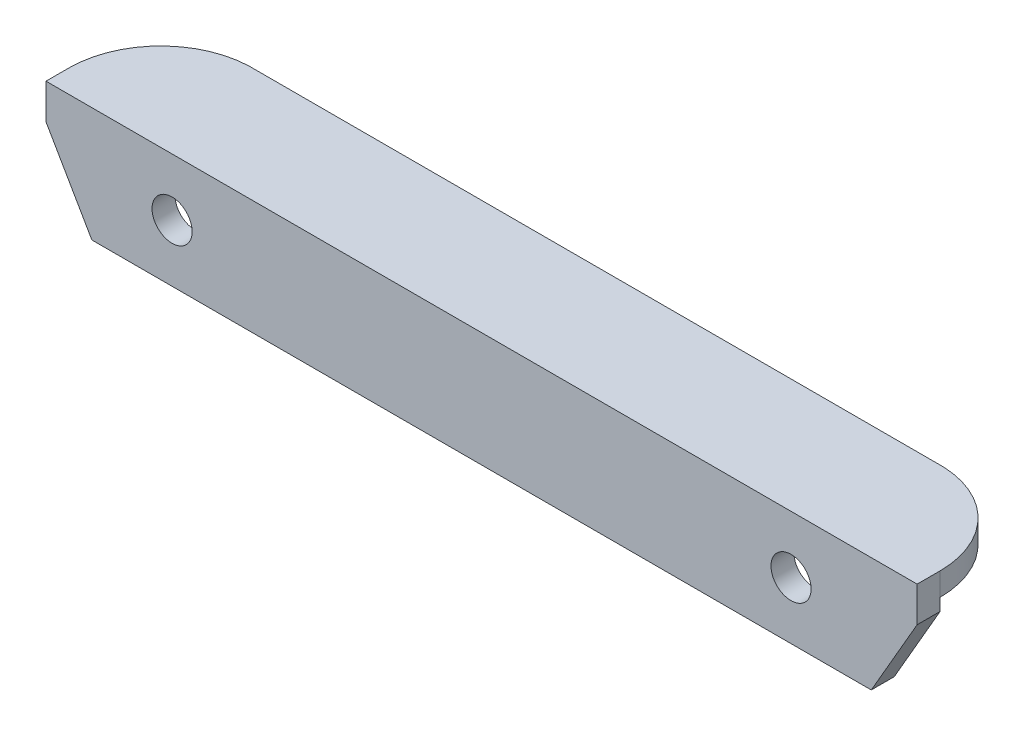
ISO-10303-21;
HEADER;
FILE_DESCRIPTION(('STEP AP214'),'2;1');
FILE_NAME('part.step','',(''),(''),'','','');
FILE_SCHEMA(('AUTOMOTIVE_DESIGN { 1 0 10303 214 1 1 1 1 }'));
ENDSEC;
DATA;
#1=APPLICATION_CONTEXT('core data for automotive mechanical design processes');
#2=APPLICATION_PROTOCOL_DEFINITION('international standard','automotive_design',2000,#1);
#3=PRODUCT_CONTEXT('',#1,'mechanical');
#4=PRODUCT('Part','Part','',(#3));
#5=PRODUCT_RELATED_PRODUCT_CATEGORY('part','',(#4));
#6=PRODUCT_DEFINITION_FORMATION('','',#4);
#7=PRODUCT_DEFINITION_CONTEXT('part definition',#1,'design');
#8=PRODUCT_DEFINITION('design','',#6,#7);
#9=PRODUCT_DEFINITION_SHAPE('','',#8);
#10=(LENGTH_UNIT() NAMED_UNIT(*) SI_UNIT(.MILLI.,.METRE.));
#11=(NAMED_UNIT(*) PLANE_ANGLE_UNIT() SI_UNIT($,.RADIAN.));
#12=(NAMED_UNIT(*) SI_UNIT($,.STERADIAN.) SOLID_ANGLE_UNIT());
#13=UNCERTAINTY_MEASURE_WITH_UNIT(LENGTH_MEASURE(1.E-05),#10,'distance_accuracy_value','');
#14=(GEOMETRIC_REPRESENTATION_CONTEXT(3) GLOBAL_UNCERTAINTY_ASSIGNED_CONTEXT((#13)) GLOBAL_UNIT_ASSIGNED_CONTEXT((#10,
#11,#12)) REPRESENTATION_CONTEXT('',''));
#15=CARTESIAN_POINT('',(0.,0.,0.));
#16=DIRECTION('',(0.,0.,1.));
#17=DIRECTION('',(1.,0.,0.));
#18=AXIS2_PLACEMENT_3D('',#15,#16,#17);
#19=CARTESIAN_POINT('',(76.,8.,-10.));
#20=DIRECTION('',(0.,1.,0.));
#21=DIRECTION('',(0.,0.,1.));
#22=AXIS2_PLACEMENT_3D('',#19,#20,#21);
#23=PLANE('',#22);
#24=CARTESIAN_POINT('',(8.,8.00000000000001,-2.00620979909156));
#25=DIRECTION('',(0.,1.,0.));
#26=DIRECTION('',(0.,0.,1.));
#27=AXIS2_PLACEMENT_3D('',#24,#25,#26);
#28=CIRCLE('',#27,7.9999987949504);
#29=CARTESIAN_POINT('',(7.68488265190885,8.00000000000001,-10.));
#30=VERTEX_POINT('',#29);
#31=CARTESIAN_POINT('',(0.,8.,-2.00620979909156));
#32=VERTEX_POINT('',#31);
#33=EDGE_CURVE('E192',#30,#32,#28,.T.);
#34=ORIENTED_EDGE('',*,*,#33,.F.);
#35=DIRECTION('',(-1.,0.,0.));
#36=VECTOR('',#35,1.);
#37=CARTESIAN_POINT('',(76.,8.,-10.));
#38=LINE('',#37,#36);
#39=CARTESIAN_POINT('',(68.315117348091,8.00000000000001,-10.));
#40=VERTEX_POINT('',#39);
#41=EDGE_CURVE('E133',#40,#30,#38,.T.);
#42=ORIENTED_EDGE('',*,*,#41,.F.);
#43=CARTESIAN_POINT('',(68.,8.00000000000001,-2.00620979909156));
#44=DIRECTION('',(0.,1.,0.));
#45=DIRECTION('',(0.,0.,1.));
#46=AXIS2_PLACEMENT_3D('',#43,#44,#45);
#47=CIRCLE('',#46,7.99999879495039);
#48=CARTESIAN_POINT('',(76.,7.99999999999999,-2.00620979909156));
#49=VERTEX_POINT('',#48);
#50=EDGE_CURVE('E159',#49,#40,#47,.T.);
#51=ORIENTED_EDGE('',*,*,#50,.F.);
#52=DIRECTION('',(0.,0.,-1.));
#53=VECTOR('',#52,1.);
#54=CARTESIAN_POINT('',(76.,8.,-10.));
#55=LINE('',#54,#53);
#56=CARTESIAN_POINT('',(76.,8.,-2.));
#57=VERTEX_POINT('',#56);
#58=EDGE_CURVE('E203',#57,#49,#55,.T.);
#59=ORIENTED_EDGE('',*,*,#58,.F.);
#60=DIRECTION('',(-1.,0.,0.));
#61=VECTOR('',#60,1.);
#62=CARTESIAN_POINT('',(76.,8.,-2.));
#63=LINE('',#62,#61);
#64=CARTESIAN_POINT('',(0.,8.,-2.));
#65=VERTEX_POINT('',#64);
#66=EDGE_CURVE('E127',#57,#65,#63,.T.);
#67=ORIENTED_EDGE('',*,*,#66,.T.);
#68=DIRECTION('',(0.,0.,-1.));
#69=VECTOR('',#68,1.);
#70=CARTESIAN_POINT('',(0.,8.,-10.));
#71=LINE('',#70,#69);
#72=EDGE_CURVE('E158',#65,#32,#71,.T.);
#73=ORIENTED_EDGE('',*,*,#72,.T.);
#74=EDGE_LOOP('',(#34,#42,#51,#59,#67,#73));
#75=FACE_BOUND('',#74,.T.);
#76=ADVANCED_FACE('F32',(#75),#23,.F.);
#77=CARTESIAN_POINT('',(76.,10.,-10.));
#78=DIRECTION('',(0.,0.,1.));
#79=DIRECTION('',(0.,-1.,0.));
#80=AXIS2_PLACEMENT_3D('',#77,#78,#79);
#81=PLANE('',#80);
#82=DIRECTION('',(0.,1.,0.));
#83=VECTOR('',#82,1.);
#84=CARTESIAN_POINT('',(7.68488265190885,-66.,-10.));
#85=LINE('',#84,#83);
#86=CARTESIAN_POINT('',(7.68488265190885,10.,-10.));
#87=VERTEX_POINT('',#86);
#88=EDGE_CURVE('E186',#30,#87,#85,.T.);
#89=ORIENTED_EDGE('',*,*,#88,.T.);
#90=DIRECTION('',(-1.,0.,0.));
#91=VECTOR('',#90,1.);
#92=CARTESIAN_POINT('',(76.,10.,-10.));
#93=LINE('',#92,#91);
#94=CARTESIAN_POINT('',(68.315117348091,10.,-10.));
#95=VERTEX_POINT('',#94);
#96=EDGE_CURVE('E177',#95,#87,#93,.T.);
#97=ORIENTED_EDGE('',*,*,#96,.F.);
#98=DIRECTION('',(0.,1.,0.));
#99=VECTOR('',#98,1.);
#100=CARTESIAN_POINT('',(68.315117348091,-66.,-10.));
#101=LINE('',#100,#99);
#102=EDGE_CURVE('E163',#40,#95,#101,.T.);
#103=ORIENTED_EDGE('',*,*,#102,.F.);
#104=ORIENTED_EDGE('',*,*,#41,.T.);
#105=EDGE_LOOP('',(#89,#97,#103,#104));
#106=FACE_BOUND('',#105,.T.);
#107=ADVANCED_FACE('F184',(#106),#81,.F.);
#108=CARTESIAN_POINT('',(76.,10.,0.));
#109=DIRECTION('',(0.,-1.,0.));
#110=DIRECTION('',(0.,0.,-1.));
#111=AXIS2_PLACEMENT_3D('',#108,#109,#110);
#112=PLANE('',#111);
#113=CARTESIAN_POINT('',(8.,10.,-2.00620979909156));
#114=DIRECTION('',(0.,1.,0.));
#115=DIRECTION('',(0.,0.,1.));
#116=AXIS2_PLACEMENT_3D('',#113,#114,#115);
#117=CIRCLE('',#116,7.9999987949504);
#118=CARTESIAN_POINT('',(0.,10.,-2.00620979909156));
#119=VERTEX_POINT('',#118);
#120=EDGE_CURVE('E141',#87,#119,#117,.T.);
#121=ORIENTED_EDGE('',*,*,#120,.T.);
#122=DIRECTION('',(0.,0.,1.));
#123=VECTOR('',#122,1.);
#124=CARTESIAN_POINT('',(0.,10.,0.));
#125=LINE('',#124,#123);
#126=CARTESIAN_POINT('',(0.,10.,0.));
#127=VERTEX_POINT('',#126);
#128=EDGE_CURVE('E161',#119,#127,#125,.T.);
#129=ORIENTED_EDGE('',*,*,#128,.T.);
#130=DIRECTION('',(-1.,0.,0.));
#131=VECTOR('',#130,1.);
#132=CARTESIAN_POINT('',(76.,10.,0.));
#133=LINE('',#132,#131);
#134=CARTESIAN_POINT('',(76.,10.,0.));
#135=VERTEX_POINT('',#134);
#136=EDGE_CURVE('E174',#135,#127,#133,.T.);
#137=ORIENTED_EDGE('',*,*,#136,.F.);
#138=DIRECTION('',(0.,0.,1.));
#139=VECTOR('',#138,1.);
#140=CARTESIAN_POINT('',(76.,10.,0.));
#141=LINE('',#140,#139);
#142=CARTESIAN_POINT('',(76.,10.,-2.00620979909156));
#143=VERTEX_POINT('',#142);
#144=EDGE_CURVE('E204',#143,#135,#141,.T.);
#145=ORIENTED_EDGE('',*,*,#144,.F.);
#146=CARTESIAN_POINT('',(68.,10.,-2.00620979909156));
#147=DIRECTION('',(0.,1.,0.));
#148=DIRECTION('',(0.,0.,1.));
#149=AXIS2_PLACEMENT_3D('',#146,#147,#148);
#150=CIRCLE('',#149,7.99999879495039);
#151=EDGE_CURVE('E194',#143,#95,#150,.T.);
#152=ORIENTED_EDGE('',*,*,#151,.T.);
#153=ORIENTED_EDGE('',*,*,#96,.T.);
#154=EDGE_LOOP('',(#121,#129,#137,#145,#152,#153));
#155=FACE_BOUND('',#154,.T.);
#156=ADVANCED_FACE('F223',(#155),#112,.F.);
#157=CARTESIAN_POINT('',(76.,0.,-2.));
#158=DIRECTION('',(0.,1.,0.));
#159=DIRECTION('',(0.,0.,1.));
#160=AXIS2_PLACEMENT_3D('',#157,#158,#159);
#161=PLANE('',#160);
#162=DIRECTION('',(-1.,0.,0.));
#163=VECTOR('',#162,1.);
#164=CARTESIAN_POINT('',(76.,0.,-2.));
#165=LINE('',#164,#163);
#166=CARTESIAN_POINT('',(72.,0.,-2.));
#167=VERTEX_POINT('',#166);
#168=CARTESIAN_POINT('',(4.,0.,-2.));
#169=VERTEX_POINT('',#168);
#170=EDGE_CURVE('E119',#167,#169,#165,.T.);
#171=ORIENTED_EDGE('',*,*,#170,.F.);
#172=DIRECTION('',(0.,0.,-1.));
#173=VECTOR('',#172,1.);
#174=CARTESIAN_POINT('',(72.,0.,74.));
#175=LINE('',#174,#173);
#176=CARTESIAN_POINT('',(72.,0.,0.));
#177=VERTEX_POINT('',#176);
#178=EDGE_CURVE('E107',#177,#167,#175,.T.);
#179=ORIENTED_EDGE('',*,*,#178,.F.);
#180=DIRECTION('',(-1.,0.,0.));
#181=VECTOR('',#180,1.);
#182=CARTESIAN_POINT('',(76.,0.,0.));
#183=LINE('',#182,#181);
#184=CARTESIAN_POINT('',(4.,0.,0.));
#185=VERTEX_POINT('',#184);
#186=EDGE_CURVE('E172',#177,#185,#183,.T.);
#187=ORIENTED_EDGE('',*,*,#186,.T.);
#188=DIRECTION('',(0.,0.,-1.));
#189=VECTOR('',#188,1.);
#190=CARTESIAN_POINT('',(4.,0.,74.));
#191=LINE('',#190,#189);
#192=EDGE_CURVE('E125',#185,#169,#191,.T.);
#193=ORIENTED_EDGE('',*,*,#192,.T.);
#194=EDGE_LOOP('',(#171,#179,#187,#193));
#195=FACE_BOUND('',#194,.T.);
#196=ADVANCED_FACE('F34',(#195),#161,.F.);
#197=CARTESIAN_POINT('',(76.,8.,-2.));
#198=DIRECTION('',(0.,0.,1.));
#199=DIRECTION('',(1.,0.,0.));
#200=AXIS2_PLACEMENT_3D('',#197,#198,#199);
#201=PLANE('',#200);
#202=CARTESIAN_POINT('',(65.,5.,-2.));
#203=DIRECTION('',(0.,0.,-1.));
#204=DIRECTION('',(-1.,0.,0.));
#205=AXIS2_PLACEMENT_3D('',#202,#203,#204);
#206=CIRCLE('',#205,1.75);
#207=CARTESIAN_POINT('',(63.25,5.,-2.));
#208=VERTEX_POINT('',#207);
#209=EDGE_CURVE('E145',#208,#208,#206,.T.);
#210=ORIENTED_EDGE('',*,*,#209,.F.);
#211=EDGE_LOOP('',(#210));
#212=FACE_BOUND('',#211,.T.);
#213=CARTESIAN_POINT('',(11.,5.,-2.));
#214=DIRECTION('',(0.,0.,-1.));
#215=DIRECTION('',(-1.,0.,0.));
#216=AXIS2_PLACEMENT_3D('',#213,#214,#215);
#217=CIRCLE('',#216,1.75);
#218=CARTESIAN_POINT('',(9.25,5.,-2.));
#219=VERTEX_POINT('',#218);
#220=EDGE_CURVE('E142',#219,#219,#217,.T.);
#221=ORIENTED_EDGE('',*,*,#220,.F.);
#222=EDGE_LOOP('',(#221));
#223=FACE_BOUND('',#222,.T.);
#224=DIRECTION('',(0.,1.,0.));
#225=VECTOR('',#224,1.);
#226=CARTESIAN_POINT('',(76.,8.,-2.));
#227=LINE('',#226,#225);
#228=CARTESIAN_POINT('',(76.,6.9282032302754,-2.));
#229=VERTEX_POINT('',#228);
#230=EDGE_CURVE('E122',#229,#57,#227,.T.);
#231=ORIENTED_EDGE('',*,*,#230,.F.);
#232=DIRECTION('',(0.500000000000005,0.866025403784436,0.));
#233=VECTOR('',#232,1.);
#234=CARTESIAN_POINT('',(76.,6.9282032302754,-2.));
#235=LINE('',#234,#233);
#236=EDGE_CURVE('E47',#167,#229,#235,.T.);
#237=ORIENTED_EDGE('',*,*,#236,.F.);
#238=ORIENTED_EDGE('',*,*,#170,.T.);
#239=DIRECTION('',(0.500000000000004,-0.866025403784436,0.));
#240=VECTOR('',#239,1.);
#241=CARTESIAN_POINT('',(0.,6.92820323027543,-2.));
#242=LINE('',#241,#240);
#243=CARTESIAN_POINT('',(0.,6.92820323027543,-2.));
#244=VERTEX_POINT('',#243);
#245=EDGE_CURVE('E147',#244,#169,#242,.T.);
#246=ORIENTED_EDGE('',*,*,#245,.F.);
#247=DIRECTION('',(0.,1.,0.));
#248=VECTOR('',#247,1.);
#249=CARTESIAN_POINT('',(0.,8.,-2.));
#250=LINE('',#249,#248);
#251=EDGE_CURVE('E152',#244,#65,#250,.T.);
#252=ORIENTED_EDGE('',*,*,#251,.T.);
#253=ORIENTED_EDGE('',*,*,#66,.F.);
#254=EDGE_LOOP('',(#231,#237,#238,#246,#252,#253));
#255=FACE_BOUND('',#254,.T.);
#256=ADVANCED_FACE('F117',(#212,#223,#255),#201,.F.);
#257=CARTESIAN_POINT('',(76.,0.,0.));
#258=DIRECTION('',(0.,0.,-1.));
#259=DIRECTION('',(-1.,0.,0.));
#260=AXIS2_PLACEMENT_3D('',#257,#258,#259);
#261=PLANE('',#260);
#262=CARTESIAN_POINT('',(65.,5.,0.));
#263=DIRECTION('',(0.,0.,-1.));
#264=DIRECTION('',(-1.,0.,0.));
#265=AXIS2_PLACEMENT_3D('',#262,#263,#264);
#266=CIRCLE('',#265,1.75);
#267=CARTESIAN_POINT('',(63.25,5.,0.));
#268=VERTEX_POINT('',#267);
#269=EDGE_CURVE('E143',#268,#268,#266,.T.);
#270=ORIENTED_EDGE('',*,*,#269,.T.);
#271=EDGE_LOOP('',(#270));
#272=FACE_BOUND('',#271,.T.);
#273=CARTESIAN_POINT('',(11.,5.,0.));
#274=DIRECTION('',(0.,0.,-1.));
#275=DIRECTION('',(-1.,0.,0.));
#276=AXIS2_PLACEMENT_3D('',#273,#274,#275);
#277=CIRCLE('',#276,1.75);
#278=CARTESIAN_POINT('',(9.25,5.,0.));
#279=VERTEX_POINT('',#278);
#280=EDGE_CURVE('E138',#279,#279,#277,.T.);
#281=ORIENTED_EDGE('',*,*,#280,.T.);
#282=EDGE_LOOP('',(#281));
#283=FACE_BOUND('',#282,.T.);
#284=ORIENTED_EDGE('',*,*,#186,.F.);
#285=DIRECTION('',(0.500000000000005,0.866025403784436,0.));
#286=VECTOR('',#285,1.);
#287=CARTESIAN_POINT('',(73.,1.73205080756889,0.));
#288=LINE('',#287,#286);
#289=CARTESIAN_POINT('',(76.,6.9282032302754,0.));
#290=VERTEX_POINT('',#289);
#291=EDGE_CURVE('E110',#177,#290,#288,.T.);
#292=ORIENTED_EDGE('',*,*,#291,.T.);
#293=DIRECTION('',(0.,-1.,0.));
#294=VECTOR('',#293,1.);
#295=CARTESIAN_POINT('',(76.,0.,0.));
#296=LINE('',#295,#294);
#297=EDGE_CURVE('E166',#135,#290,#296,.T.);
#298=ORIENTED_EDGE('',*,*,#297,.F.);
#299=ORIENTED_EDGE('',*,*,#136,.T.);
#300=DIRECTION('',(0.,-1.,0.));
#301=VECTOR('',#300,1.);
#302=CARTESIAN_POINT('',(0.,0.,0.));
#303=LINE('',#302,#301);
#304=CARTESIAN_POINT('',(0.,6.92820323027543,0.));
#305=VERTEX_POINT('',#304);
#306=EDGE_CURVE('E170',#127,#305,#303,.T.);
#307=ORIENTED_EDGE('',*,*,#306,.T.);
#308=DIRECTION('',(0.500000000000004,-0.866025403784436,0.));
#309=VECTOR('',#308,1.);
#310=CARTESIAN_POINT('',(22.0000000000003,-31.17691453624,0.));
#311=LINE('',#310,#309);
#312=EDGE_CURVE('E54',#305,#185,#311,.T.);
#313=ORIENTED_EDGE('',*,*,#312,.T.);
#314=EDGE_LOOP('',(#284,#292,#298,#299,#307,#313));
#315=FACE_BOUND('',#314,.T.);
#316=ADVANCED_FACE('F212',(#272,#283,#315),#261,.F.);
#317=CARTESIAN_POINT('',(76.,0.,0.));
#318=DIRECTION('',(-1.,0.,0.));
#319=DIRECTION('',(0.,0.,1.));
#320=AXIS2_PLACEMENT_3D('',#317,#318,#319);
#321=PLANE('',#320);
#322=ORIENTED_EDGE('',*,*,#297,.T.);
#323=DIRECTION('',(0.,0.,-1.));
#324=VECTOR('',#323,1.);
#325=CARTESIAN_POINT('',(76.,6.9282032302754,0.));
#326=LINE('',#325,#324);
#327=EDGE_CURVE('E12',#290,#229,#326,.T.);
#328=ORIENTED_EDGE('',*,*,#327,.T.);
#329=ORIENTED_EDGE('',*,*,#230,.T.);
#330=ORIENTED_EDGE('',*,*,#58,.T.);
#331=DIRECTION('',(0.,1.,0.));
#332=VECTOR('',#331,1.);
#333=CARTESIAN_POINT('',(75.9999993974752,-66.,-2.00620979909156));
#334=LINE('',#333,#332);
#335=EDGE_CURVE('E126',#49,#143,#334,.T.);
#336=ORIENTED_EDGE('',*,*,#335,.T.);
#337=ORIENTED_EDGE('',*,*,#144,.T.);
#338=EDGE_LOOP('',(#322,#328,#329,#330,#336,#337));
#339=FACE_BOUND('',#338,.T.);
#340=ADVANCED_FACE('F210',(#339),#321,.F.);
#341=CARTESIAN_POINT('',(0.,0.,0.));
#342=DIRECTION('',(-1.,0.,0.));
#343=DIRECTION('',(0.,0.,1.));
#344=AXIS2_PLACEMENT_3D('',#341,#342,#343);
#345=PLANE('',#344);
#346=DIRECTION('',(0.,0.,-1.));
#347=VECTOR('',#346,1.);
#348=CARTESIAN_POINT('',(0.,6.92820323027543,0.));
#349=LINE('',#348,#347);
#350=EDGE_CURVE('E40',#305,#244,#349,.T.);
#351=ORIENTED_EDGE('',*,*,#350,.F.);
#352=ORIENTED_EDGE('',*,*,#306,.F.);
#353=ORIENTED_EDGE('',*,*,#128,.F.);
#354=DIRECTION('',(0.,1.,0.));
#355=VECTOR('',#354,1.);
#356=CARTESIAN_POINT('',(6.02524800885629E-07,-66.,-2.00620979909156));
#357=LINE('',#356,#355);
#358=EDGE_CURVE('E130',#32,#119,#357,.T.);
#359=ORIENTED_EDGE('',*,*,#358,.F.);
#360=ORIENTED_EDGE('',*,*,#72,.F.);
#361=ORIENTED_EDGE('',*,*,#251,.F.);
#362=EDGE_LOOP('',(#351,#352,#353,#359,#360,#361));
#363=FACE_BOUND('',#362,.T.);
#364=ADVANCED_FACE('F155',(#363),#345,.T.);
#365=CARTESIAN_POINT('',(68.,-66.,-2.00620979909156));
#366=DIRECTION('',(0.,1.,0.));
#367=DIRECTION('',(0.,0.,1.));
#368=AXIS2_PLACEMENT_3D('',#365,#366,#367);
#369=CYLINDRICAL_SURFACE('',#368,7.99999879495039);
#370=ORIENTED_EDGE('',*,*,#50,.T.);
#371=ORIENTED_EDGE('',*,*,#102,.T.);
#372=ORIENTED_EDGE('',*,*,#151,.F.);
#373=ORIENTED_EDGE('',*,*,#335,.F.);
#374=EDGE_LOOP('',(#370,#371,#372,#373));
#375=FACE_BOUND('',#374,.T.);
#376=ADVANCED_FACE('F227',(#375),#369,.T.);
#377=CARTESIAN_POINT('',(8.,-66.,-2.00620979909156));
#378=DIRECTION('',(0.,1.,0.));
#379=DIRECTION('',(0.,0.,1.));
#380=AXIS2_PLACEMENT_3D('',#377,#378,#379);
#381=CYLINDRICAL_SURFACE('',#380,7.9999987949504);
#382=ORIENTED_EDGE('',*,*,#33,.T.);
#383=ORIENTED_EDGE('',*,*,#358,.T.);
#384=ORIENTED_EDGE('',*,*,#120,.F.);
#385=ORIENTED_EDGE('',*,*,#88,.F.);
#386=EDGE_LOOP('',(#382,#383,#384,#385));
#387=FACE_BOUND('',#386,.T.);
#388=ADVANCED_FACE('F224',(#387),#381,.T.);
#389=CARTESIAN_POINT('',(11.,5.,74.));
#390=DIRECTION('',(0.,0.,-1.));
#391=DIRECTION('',(-1.,0.,0.));
#392=AXIS2_PLACEMENT_3D('',#389,#390,#391);
#393=CYLINDRICAL_SURFACE('',#392,1.75);
#394=ORIENTED_EDGE('',*,*,#220,.T.);
#395=EDGE_LOOP('',(#394));
#396=FACE_BOUND('',#395,.T.);
#397=ORIENTED_EDGE('',*,*,#280,.F.);
#398=EDGE_LOOP('',(#397));
#399=FACE_BOUND('',#398,.T.);
#400=ADVANCED_FACE('F226',(#396,#399),#393,.F.);
#401=CARTESIAN_POINT('',(65.,5.,74.));
#402=DIRECTION('',(0.,0.,-1.));
#403=DIRECTION('',(-1.,0.,0.));
#404=AXIS2_PLACEMENT_3D('',#401,#402,#403);
#405=CYLINDRICAL_SURFACE('',#404,1.75);
#406=ORIENTED_EDGE('',*,*,#209,.T.);
#407=EDGE_LOOP('',(#406));
#408=FACE_BOUND('',#407,.T.);
#409=ORIENTED_EDGE('',*,*,#269,.F.);
#410=EDGE_LOOP('',(#409));
#411=FACE_BOUND('',#410,.T.);
#412=ADVANCED_FACE('F233',(#408,#411),#405,.F.);
#413=CARTESIAN_POINT('',(0.,6.92820323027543,74.));
#414=DIRECTION('',(0.866025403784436,0.500000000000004,0.));
#415=DIRECTION('',(-0.500000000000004,0.866025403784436,0.));
#416=AXIS2_PLACEMENT_3D('',#413,#414,#415);
#417=PLANE('',#416);
#418=ORIENTED_EDGE('',*,*,#350,.T.);
#419=ORIENTED_EDGE('',*,*,#245,.T.);
#420=ORIENTED_EDGE('',*,*,#192,.F.);
#421=ORIENTED_EDGE('',*,*,#312,.F.);
#422=EDGE_LOOP('',(#418,#419,#420,#421));
#423=FACE_BOUND('',#422,.T.);
#424=ADVANCED_FACE('F146',(#423),#417,.F.);
#425=CARTESIAN_POINT('',(76.,6.9282032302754,74.));
#426=DIRECTION('',(-0.866025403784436,0.500000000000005,0.));
#427=DIRECTION('',(-0.500000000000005,-0.866025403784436,0.));
#428=AXIS2_PLACEMENT_3D('',#425,#426,#427);
#429=PLANE('',#428);
#430=ORIENTED_EDGE('',*,*,#178,.T.);
#431=ORIENTED_EDGE('',*,*,#236,.T.);
#432=ORIENTED_EDGE('',*,*,#327,.F.);
#433=ORIENTED_EDGE('',*,*,#291,.F.);
#434=EDGE_LOOP('',(#430,#431,#432,#433));
#435=FACE_BOUND('',#434,.T.);
#436=ADVANCED_FACE('F108',(#435),#429,.F.);
#437=CLOSED_SHELL('',(#76,#107,#156,#196,#256,#316,#340,#364,#376,#388,#400,#412,#424,#436));
#438=MANIFOLD_SOLID_BREP('B2',#437);
#439=ADVANCED_BREP_SHAPE_REPRESENTATION('',(#18,#438),#14);
#440=SHAPE_DEFINITION_REPRESENTATION(#9,#439);
ENDSEC;
END-ISO-10303-21;
